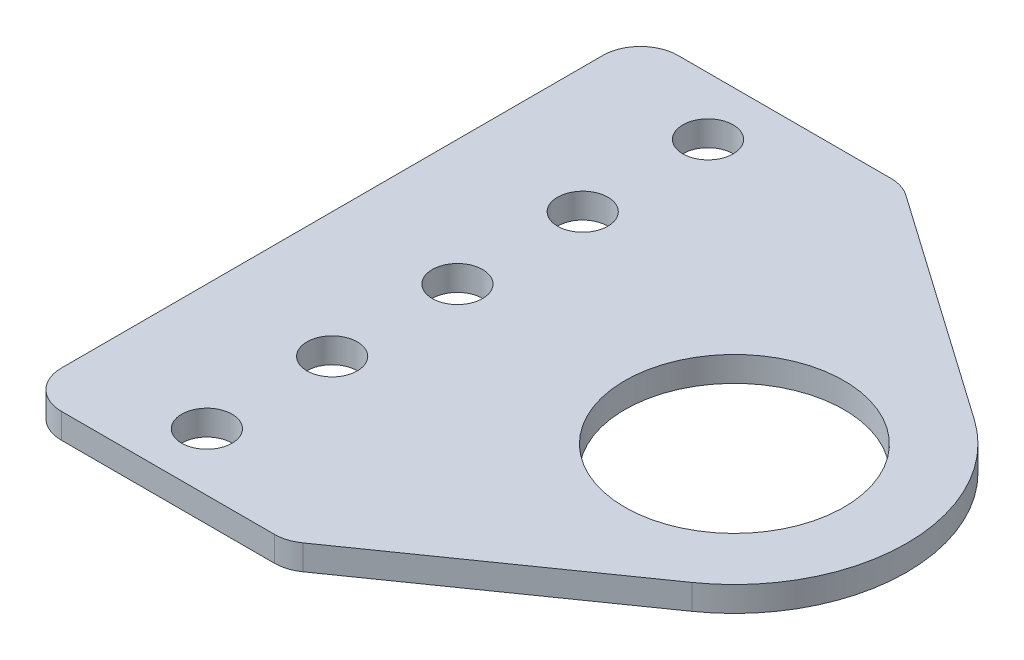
from build123d import *

# Parameters (mm, degrees)
SKETCH1_R           = 11.1125
SKETCH1_R_2         = 2.5527
BOSS_EXTRUDE1_DEPTH = 2.54


with BuildPart() as part:
    # Sketch1 → Boss-Extrude1 (new body)
    with BuildSketch(Plane(origin=(0, 0, 0), x_dir=(1, 0, 0), z_dir=(0, 1, 0))):
        with BuildLine():
            Line((-40.775, -27.44), (-40.775, 27.44))
            ThreePointArc((-40.775, 27.44), (-39.659076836, 30.134076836), (-36.965, 31.25))
            Line((-36.965, 31.25), (-15.375, 31.25))
            ThreePointArc((-15.375, 31.25), (-14.228907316, 31.073534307), (-13.188980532, 30.560483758))
            Line((-13.188980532, 30.560483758), (10.019255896, 14.302217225))
            ThreePointArc((10.019255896, 14.302217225), (17.4625, 0), (10.019255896, -14.302217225))
            Line((10.019255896, -14.302217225), (-13.188980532, -30.560483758))
            ThreePointArc((-13.188980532, -30.560483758), (-14.228907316, -31.073534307), (-15.375, -31.25))
            Line((-15.375, -31.25), (-36.965, -31.25))
            ThreePointArc((-36.965, -31.25), (-39.659076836, -30.134076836), (-40.775, -27.44))
        make_face()
        with Locations(Location((0, 0, 0), (0, 0, 270))):
            Circle(SKETCH1_R, mode=Mode.SUBTRACT)
        with Locations(Location((-28.075, 25.4, 0), (0, 0, 270))):
            Circle(SKETCH1_R_2, mode=Mode.SUBTRACT)
        with Locations(Location((-28.075, 12.7, 0), (0, 0, 270))):
            Circle(SKETCH1_R_2, mode=Mode.SUBTRACT)
        with Locations(Location((-28.075, 0, 0), (0, 0, 270))):
            Circle(SKETCH1_R_2, mode=Mode.SUBTRACT)
        with Locations(Location((-28.075, -12.7, 0), (0, 0, 270))):
            Circle(SKETCH1_R_2, mode=Mode.SUBTRACT)
        with Locations(Location((-28.075, -25.4, 0), (0, 0, 270))):
            Circle(SKETCH1_R_2, mode=Mode.SUBTRACT)
    extrude(amount=BOSS_EXTRUDE1_DEPTH)


solid = part.part
